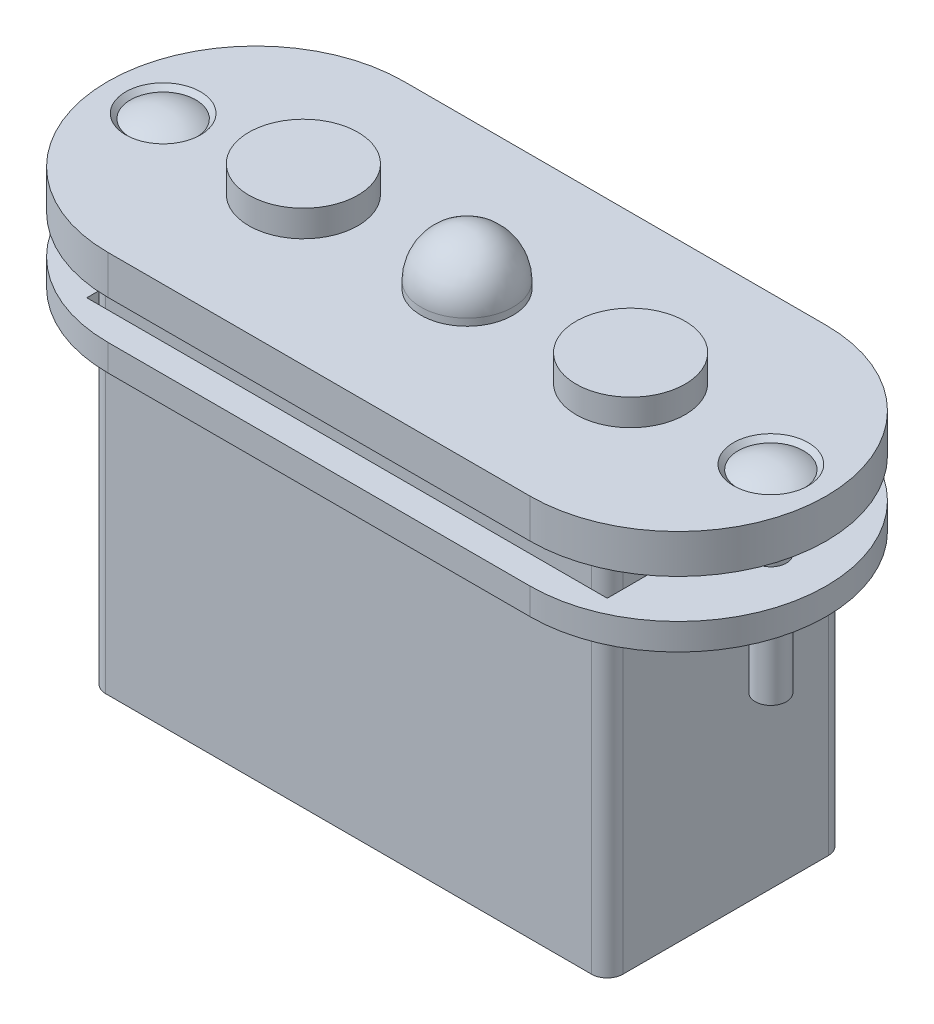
ISO-10303-21;
HEADER;
FILE_DESCRIPTION(('STEP AP214'),'2;1');
FILE_NAME('part.step','',(''),(''),'','','');
FILE_SCHEMA(('AUTOMOTIVE_DESIGN { 1 0 10303 214 1 1 1 1 }'));
ENDSEC;
DATA;
#1=APPLICATION_CONTEXT('core data for automotive mechanical design processes');
#2=APPLICATION_PROTOCOL_DEFINITION('international standard','automotive_design',2000,#1);
#3=PRODUCT_CONTEXT('',#1,'mechanical');
#4=PRODUCT('Part','Part','',(#3));
#5=PRODUCT_RELATED_PRODUCT_CATEGORY('part','',(#4));
#6=PRODUCT_DEFINITION_FORMATION('','',#4);
#7=PRODUCT_DEFINITION_CONTEXT('part definition',#1,'design');
#8=PRODUCT_DEFINITION('design','',#6,#7);
#9=PRODUCT_DEFINITION_SHAPE('','',#8);
#10=(LENGTH_UNIT() NAMED_UNIT(*) SI_UNIT(.MILLI.,.METRE.));
#11=(NAMED_UNIT(*) PLANE_ANGLE_UNIT() SI_UNIT($,.RADIAN.));
#12=(NAMED_UNIT(*) SI_UNIT($,.STERADIAN.) SOLID_ANGLE_UNIT());
#13=UNCERTAINTY_MEASURE_WITH_UNIT(LENGTH_MEASURE(1.E-05),#10,'distance_accuracy_value','');
#14=(GEOMETRIC_REPRESENTATION_CONTEXT(3) GLOBAL_UNCERTAINTY_ASSIGNED_CONTEXT((#13)) GLOBAL_UNIT_ASSIGNED_CONTEXT((#10,
#11,#12)) REPRESENTATION_CONTEXT('',''));
#15=CARTESIAN_POINT('',(0.,0.,0.));
#16=DIRECTION('',(0.,0.,1.));
#17=DIRECTION('',(1.,0.,0.));
#18=AXIS2_PLACEMENT_3D('',#15,#16,#17);
#19=CARTESIAN_POINT('',(19.5,-1.17500000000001,0.));
#20=DIRECTION('',(0.,1.,0.));
#21=DIRECTION('',(1.,0.,0.));
#22=AXIS2_PLACEMENT_3D('',#19,#20,#21);
#23=SPHERICAL_SURFACE('',#22,3.97500000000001);
#24=CARTESIAN_POINT('',(19.5,2.2,0.));
#25=DIRECTION('',(0.,1.,0.));
#26=DIRECTION('',(0.,0.,1.));
#27=AXIS2_PLACEMENT_3D('',#24,#25,#26);
#28=CIRCLE('',#27,2.1);
#29=CARTESIAN_POINT('',(19.5,2.2,2.1));
#30=VERTEX_POINT('',#29);
#31=EDGE_CURVE('E11',#30,#30,#28,.T.);
#32=ORIENTED_EDGE('',*,*,#31,.T.);
#33=EDGE_LOOP('',(#32));
#34=FACE_BOUND('',#33,.T.);
#35=ADVANCED_FACE('F46',(#34),#23,.T.);
#36=CARTESIAN_POINT('',(19.5,2.2,0.));
#37=DIRECTION('',(0.,1.,0.));
#38=DIRECTION('',(0.,0.,1.));
#39=AXIS2_PLACEMENT_3D('',#36,#37,#38);
#40=CONICAL_SURFACE('',#39,2.1,0.785398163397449);
#41=CARTESIAN_POINT('',(19.5,1.1,0.));
#42=DIRECTION('',(0.,1.,0.));
#43=DIRECTION('',(0.,0.,1.));
#44=AXIS2_PLACEMENT_3D('',#41,#42,#43);
#45=CIRCLE('',#44,1.);
#46=CARTESIAN_POINT('',(19.5,1.1,1.));
#47=VERTEX_POINT('',#46);
#48=EDGE_CURVE('E52',#47,#47,#45,.T.);
#49=ORIENTED_EDGE('',*,*,#48,.T.);
#50=EDGE_LOOP('',(#49));
#51=FACE_BOUND('',#50,.T.);
#52=ORIENTED_EDGE('',*,*,#31,.F.);
#53=EDGE_LOOP('',(#52));
#54=FACE_BOUND('',#53,.T.);
#55=ADVANCED_FACE('F72',(#51,#54),#40,.T.);
#56=CARTESIAN_POINT('',(19.5,1.15,0.));
#57=DIRECTION('',(0.,1.,0.));
#58=DIRECTION('',(0.,0.,1.));
#59=AXIS2_PLACEMENT_3D('',#56,#57,#58);
#60=CYLINDRICAL_SURFACE('',#59,0.999999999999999);
#61=CARTESIAN_POINT('',(19.5,-10.2,0.));
#62=DIRECTION('',(0.,1.,0.));
#63=DIRECTION('',(0.,0.,1.));
#64=AXIS2_PLACEMENT_3D('',#61,#62,#63);
#65=CIRCLE('',#64,0.999999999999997);
#66=CARTESIAN_POINT('',(19.5,-10.2,0.999999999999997));
#67=VERTEX_POINT('',#66);
#68=EDGE_CURVE('E56',#67,#67,#65,.T.);
#69=ORIENTED_EDGE('',*,*,#68,.T.);
#70=EDGE_LOOP('',(#69));
#71=FACE_BOUND('',#70,.T.);
#72=ORIENTED_EDGE('',*,*,#48,.F.);
#73=EDGE_LOOP('',(#72));
#74=FACE_BOUND('',#73,.T.);
#75=ADVANCED_FACE('F63',(#71,#74),#60,.T.);
#76=CARTESIAN_POINT('',(18.5,-10.2,0.));
#77=DIRECTION('',(0.,-1.,0.));
#78=DIRECTION('',(0.,0.,-1.));
#79=AXIS2_PLACEMENT_3D('',#76,#77,#78);
#80=PLANE('',#79);
#81=ORIENTED_EDGE('',*,*,#68,.F.);
#82=EDGE_LOOP('',(#81));
#83=FACE_BOUND('',#82,.T.);
#84=ADVANCED_FACE('F66',(#83),#80,.T.);
#85=CLOSED_SHELL('',(#35,#55,#75,#84));
#86=MANIFOLD_SOLID_BREP('B2',#85);
#87=CARTESIAN_POINT('',(-19.5,-1.17500000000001,0.));
#88=DIRECTION('',(0.,1.,0.));
#89=DIRECTION('',(1.,0.,0.));
#90=AXIS2_PLACEMENT_3D('',#87,#88,#89);
#91=SPHERICAL_SURFACE('',#90,3.97500000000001);
#92=CARTESIAN_POINT('',(-19.5,2.2,0.));
#93=DIRECTION('',(0.,1.,0.));
#94=DIRECTION('',(0.,0.,1.));
#95=AXIS2_PLACEMENT_3D('',#92,#93,#94);
#96=CIRCLE('',#95,2.1);
#97=CARTESIAN_POINT('',(-19.5,2.2,2.1));
#98=VERTEX_POINT('',#97);
#99=EDGE_CURVE('E45',#98,#98,#96,.T.);
#100=ORIENTED_EDGE('',*,*,#99,.T.);
#101=EDGE_LOOP('',(#100));
#102=FACE_BOUND('',#101,.T.);
#103=ADVANCED_FACE('F112',(#102),#91,.T.);
#104=CARTESIAN_POINT('',(-19.5,2.2,0.));
#105=DIRECTION('',(0.,1.,0.));
#106=DIRECTION('',(0.,0.,1.));
#107=AXIS2_PLACEMENT_3D('',#104,#105,#106);
#108=CONICAL_SURFACE('',#107,2.1,0.785398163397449);
#109=CARTESIAN_POINT('',(-19.5,1.1,0.));
#110=DIRECTION('',(0.,1.,0.));
#111=DIRECTION('',(0.,0.,1.));
#112=AXIS2_PLACEMENT_3D('',#109,#110,#111);
#113=CIRCLE('',#112,1.);
#114=CARTESIAN_POINT('',(-19.5,1.1,1.));
#115=VERTEX_POINT('',#114);
#116=EDGE_CURVE('E118',#115,#115,#113,.T.);
#117=ORIENTED_EDGE('',*,*,#116,.T.);
#118=EDGE_LOOP('',(#117));
#119=FACE_BOUND('',#118,.T.);
#120=ORIENTED_EDGE('',*,*,#99,.F.);
#121=EDGE_LOOP('',(#120));
#122=FACE_BOUND('',#121,.T.);
#123=ADVANCED_FACE('F138',(#119,#122),#108,.T.);
#124=CARTESIAN_POINT('',(-19.5,1.15,0.));
#125=DIRECTION('',(0.,1.,0.));
#126=DIRECTION('',(0.,0.,1.));
#127=AXIS2_PLACEMENT_3D('',#124,#125,#126);
#128=CYLINDRICAL_SURFACE('',#127,0.999999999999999);
#129=CARTESIAN_POINT('',(-19.5,-10.2,0.));
#130=DIRECTION('',(0.,1.,0.));
#131=DIRECTION('',(0.,0.,1.));
#132=AXIS2_PLACEMENT_3D('',#129,#130,#131);
#133=CIRCLE('',#132,0.999999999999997);
#134=CARTESIAN_POINT('',(-19.5,-10.2,0.999999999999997));
#135=VERTEX_POINT('',#134);
#136=EDGE_CURVE('E122',#135,#135,#133,.T.);
#137=ORIENTED_EDGE('',*,*,#136,.T.);
#138=EDGE_LOOP('',(#137));
#139=FACE_BOUND('',#138,.T.);
#140=ORIENTED_EDGE('',*,*,#116,.F.);
#141=EDGE_LOOP('',(#140));
#142=FACE_BOUND('',#141,.T.);
#143=ADVANCED_FACE('F129',(#139,#142),#128,.T.);
#144=CARTESIAN_POINT('',(-20.5,-10.2,0.));
#145=DIRECTION('',(0.,-1.,0.));
#146=DIRECTION('',(0.,0.,-1.));
#147=AXIS2_PLACEMENT_3D('',#144,#145,#146);
#148=PLANE('',#147);
#149=ORIENTED_EDGE('',*,*,#136,.F.);
#150=EDGE_LOOP('',(#149));
#151=FACE_BOUND('',#150,.T.);
#152=ADVANCED_FACE('F132',(#151),#148,.T.);
#153=CLOSED_SHELL('',(#103,#123,#143,#152));
#154=MANIFOLD_SOLID_BREP('B6',#153);
#155=CARTESIAN_POINT('',(-13.55,-4.2,0.));
#156=DIRECTION('',(0.,-1.,0.));
#157=DIRECTION('',(0.,0.,-1.));
#158=AXIS2_PLACEMENT_3D('',#155,#156,#157);
#159=PLANE('',#158);
#160=CARTESIAN_POINT('',(-13.55,-4.2,0.));
#161=DIRECTION('',(0.,-1.,0.));
#162=DIRECTION('',(0.,0.,-1.));
#163=AXIS2_PLACEMENT_3D('',#160,#161,#162);
#164=CIRCLE('',#163,9.5);
#165=CARTESIAN_POINT('',(-13.55,-4.2,9.5));
#166=VERTEX_POINT('',#165);
#167=CARTESIAN_POINT('',(-13.55,-4.2,-9.5));
#168=VERTEX_POINT('',#167);
#169=EDGE_CURVE('E278',#166,#168,#164,.T.);
#170=ORIENTED_EDGE('',*,*,#169,.T.);
#171=DIRECTION('',(1.,0.,0.));
#172=VECTOR('',#171,1.);
#173=CARTESIAN_POINT('',(-13.55,-4.2,-9.5));
#174=LINE('',#173,#172);
#175=CARTESIAN_POINT('',(13.55,-4.2,-9.5));
#176=VERTEX_POINT('',#175);
#177=EDGE_CURVE('E281',#168,#176,#174,.T.);
#178=ORIENTED_EDGE('',*,*,#177,.T.);
#179=CARTESIAN_POINT('',(13.55,-4.2,0.));
#180=DIRECTION('',(0.,-1.,0.));
#181=DIRECTION('',(0.,0.,-1.));
#182=AXIS2_PLACEMENT_3D('',#179,#180,#181);
#183=CIRCLE('',#182,9.5);
#184=CARTESIAN_POINT('',(13.55,-4.2,9.5));
#185=VERTEX_POINT('',#184);
#186=EDGE_CURVE('E284',#176,#185,#183,.T.);
#187=ORIENTED_EDGE('',*,*,#186,.T.);
#188=DIRECTION('',(-1.,0.,0.));
#189=VECTOR('',#188,1.);
#190=CARTESIAN_POINT('',(13.55,-4.2,9.5));
#191=LINE('',#190,#189);
#192=EDGE_CURVE('E286',#185,#166,#191,.T.);
#193=ORIENTED_EDGE('',*,*,#192,.T.);
#194=EDGE_LOOP('',(#170,#178,#187,#193));
#195=FACE_BOUND('',#194,.T.);
#196=DIRECTION('',(-1.,0.,0.));
#197=VECTOR('',#196,1.);
#198=CARTESIAN_POINT('',(-16.7,-4.2,7.7));
#199=LINE('',#198,#197);
#200=CARTESIAN_POINT('',(16.7,-4.2,7.7));
#201=VERTEX_POINT('',#200);
#202=CARTESIAN_POINT('',(-16.7,-4.2,7.7));
#203=VERTEX_POINT('',#202);
#204=EDGE_CURVE('E250',#201,#203,#199,.T.);
#205=ORIENTED_EDGE('',*,*,#204,.F.);
#206=DIRECTION('',(0.,0.,1.));
#207=VECTOR('',#206,1.);
#208=CARTESIAN_POINT('',(16.7,-4.2,-7.7));
#209=LINE('',#208,#207);
#210=CARTESIAN_POINT('',(16.7,-4.2,-7.7));
#211=VERTEX_POINT('',#210);
#212=EDGE_CURVE('E242',#211,#201,#209,.T.);
#213=ORIENTED_EDGE('',*,*,#212,.F.);
#214=DIRECTION('',(1.,0.,0.));
#215=VECTOR('',#214,1.);
#216=CARTESIAN_POINT('',(-16.7,-4.2,-7.7));
#217=LINE('',#216,#215);
#218=CARTESIAN_POINT('',(-16.7,-4.2,-7.7));
#219=VERTEX_POINT('',#218);
#220=EDGE_CURVE('E264',#219,#211,#217,.T.);
#221=ORIENTED_EDGE('',*,*,#220,.F.);
#222=DIRECTION('',(0.,0.,-1.));
#223=VECTOR('',#222,1.);
#224=CARTESIAN_POINT('',(-16.7,-4.2,-7.7));
#225=LINE('',#224,#223);
#226=EDGE_CURVE('E262',#203,#219,#225,.T.);
#227=ORIENTED_EDGE('',*,*,#226,.F.);
#228=EDGE_LOOP('',(#205,#213,#221,#227));
#229=FACE_BOUND('',#228,.T.);
#230=ADVANCED_FACE('F177',(#195,#229),#159,.T.);
#231=CARTESIAN_POINT('',(-13.55,-2.5,0.));
#232=DIRECTION('',(0.,-1.,0.));
#233=DIRECTION('',(0.,0.,-1.));
#234=AXIS2_PLACEMENT_3D('',#231,#232,#233);
#235=PLANE('',#234);
#236=CARTESIAN_POINT('',(-13.55,-2.5,0.));
#237=DIRECTION('',(0.,-1.,0.));
#238=DIRECTION('',(0.,0.,-1.));
#239=AXIS2_PLACEMENT_3D('',#236,#237,#238);
#240=CIRCLE('',#239,9.5);
#241=CARTESIAN_POINT('',(-13.55,-2.5,9.5));
#242=VERTEX_POINT('',#241);
#243=CARTESIAN_POINT('',(-13.55,-2.5,-9.5));
#244=VERTEX_POINT('',#243);
#245=EDGE_CURVE('E258',#242,#244,#240,.T.);
#246=ORIENTED_EDGE('',*,*,#245,.F.);
#247=DIRECTION('',(-1.,0.,0.));
#248=VECTOR('',#247,1.);
#249=CARTESIAN_POINT('',(13.55,-2.5,9.5));
#250=LINE('',#249,#248);
#251=CARTESIAN_POINT('',(13.55,-2.5,9.5));
#252=VERTEX_POINT('',#251);
#253=EDGE_CURVE('E282',#252,#242,#250,.T.);
#254=ORIENTED_EDGE('',*,*,#253,.F.);
#255=CARTESIAN_POINT('',(13.55,-2.5,0.));
#256=DIRECTION('',(0.,-1.,0.));
#257=DIRECTION('',(0.,0.,-1.));
#258=AXIS2_PLACEMENT_3D('',#255,#256,#257);
#259=CIRCLE('',#258,9.5);
#260=CARTESIAN_POINT('',(13.55,-2.5,-9.5));
#261=VERTEX_POINT('',#260);
#262=EDGE_CURVE('E293',#261,#252,#259,.T.);
#263=ORIENTED_EDGE('',*,*,#262,.F.);
#264=DIRECTION('',(1.,0.,0.));
#265=VECTOR('',#264,1.);
#266=CARTESIAN_POINT('',(-13.55,-2.5,-9.5));
#267=LINE('',#266,#265);
#268=EDGE_CURVE('E291',#244,#261,#267,.T.);
#269=ORIENTED_EDGE('',*,*,#268,.F.);
#270=EDGE_LOOP('',(#246,#254,#263,#269));
#271=FACE_BOUND('',#270,.T.);
#272=DIRECTION('',(0.,0.,1.));
#273=VECTOR('',#272,1.);
#274=CARTESIAN_POINT('',(16.7,-2.5,-7.7));
#275=LINE('',#274,#273);
#276=CARTESIAN_POINT('',(16.7,-2.5,-7.7));
#277=VERTEX_POINT('',#276);
#278=CARTESIAN_POINT('',(16.7,-2.5,7.7));
#279=VERTEX_POINT('',#278);
#280=EDGE_CURVE('E200',#277,#279,#275,.T.);
#281=ORIENTED_EDGE('',*,*,#280,.T.);
#282=DIRECTION('',(-1.,0.,0.));
#283=VECTOR('',#282,1.);
#284=CARTESIAN_POINT('',(-16.7,-2.5,7.7));
#285=LINE('',#284,#283);
#286=CARTESIAN_POINT('',(-16.7,-2.5,7.7));
#287=VERTEX_POINT('',#286);
#288=EDGE_CURVE('E257',#279,#287,#285,.T.);
#289=ORIENTED_EDGE('',*,*,#288,.T.);
#290=DIRECTION('',(0.,0.,-1.));
#291=VECTOR('',#290,1.);
#292=CARTESIAN_POINT('',(-16.7,-2.5,-7.7));
#293=LINE('',#292,#291);
#294=CARTESIAN_POINT('',(-16.7,-2.5,-7.7));
#295=VERTEX_POINT('',#294);
#296=EDGE_CURVE('E270',#287,#295,#293,.T.);
#297=ORIENTED_EDGE('',*,*,#296,.T.);
#298=DIRECTION('',(1.,0.,0.));
#299=VECTOR('',#298,1.);
#300=CARTESIAN_POINT('',(-16.7,-2.5,-7.7));
#301=LINE('',#300,#299);
#302=EDGE_CURVE('E251',#295,#277,#301,.T.);
#303=ORIENTED_EDGE('',*,*,#302,.T.);
#304=EDGE_LOOP('',(#281,#289,#297,#303));
#305=FACE_BOUND('',#304,.T.);
#306=ADVANCED_FACE('F311',(#271,#305),#235,.F.);
#307=CARTESIAN_POINT('',(-13.55,-4.2,0.));
#308=DIRECTION('',(0.,1.,0.));
#309=DIRECTION('',(0.,0.,1.));
#310=AXIS2_PLACEMENT_3D('',#307,#308,#309);
#311=CYLINDRICAL_SURFACE('',#310,9.5);
#312=ORIENTED_EDGE('',*,*,#245,.T.);
#313=DIRECTION('',(0.,1.,0.));
#314=VECTOR('',#313,1.);
#315=CARTESIAN_POINT('',(-13.55,-4.2,-9.5));
#316=LINE('',#315,#314);
#317=EDGE_CURVE('E110',#168,#244,#316,.T.);
#318=ORIENTED_EDGE('',*,*,#317,.F.);
#319=ORIENTED_EDGE('',*,*,#169,.F.);
#320=DIRECTION('',(0.,1.,0.));
#321=VECTOR('',#320,1.);
#322=CARTESIAN_POINT('',(-13.55,-4.2,9.5));
#323=LINE('',#322,#321);
#324=EDGE_CURVE('E288',#166,#242,#323,.T.);
#325=ORIENTED_EDGE('',*,*,#324,.T.);
#326=EDGE_LOOP('',(#312,#318,#319,#325));
#327=FACE_BOUND('',#326,.T.);
#328=ADVANCED_FACE('F179',(#327),#311,.T.);
#329=CARTESIAN_POINT('',(-13.55,-4.2,-9.5));
#330=DIRECTION('',(0.,0.,1.));
#331=DIRECTION('',(1.,0.,0.));
#332=AXIS2_PLACEMENT_3D('',#329,#330,#331);
#333=PLANE('',#332);
#334=ORIENTED_EDGE('',*,*,#268,.T.);
#335=DIRECTION('',(0.,1.,0.));
#336=VECTOR('',#335,1.);
#337=CARTESIAN_POINT('',(13.55,-4.2,-9.5));
#338=LINE('',#337,#336);
#339=EDGE_CURVE('E185',#176,#261,#338,.T.);
#340=ORIENTED_EDGE('',*,*,#339,.F.);
#341=ORIENTED_EDGE('',*,*,#177,.F.);
#342=ORIENTED_EDGE('',*,*,#317,.T.);
#343=EDGE_LOOP('',(#334,#340,#341,#342));
#344=FACE_BOUND('',#343,.T.);
#345=ADVANCED_FACE('F321',(#344),#333,.F.);
#346=CARTESIAN_POINT('',(13.55,-4.2,0.));
#347=DIRECTION('',(0.,1.,0.));
#348=DIRECTION('',(0.,0.,1.));
#349=AXIS2_PLACEMENT_3D('',#346,#347,#348);
#350=CYLINDRICAL_SURFACE('',#349,9.5);
#351=ORIENTED_EDGE('',*,*,#262,.T.);
#352=DIRECTION('',(0.,1.,0.));
#353=VECTOR('',#352,1.);
#354=CARTESIAN_POINT('',(13.55,-4.2,9.5));
#355=LINE('',#354,#353);
#356=EDGE_CURVE('E298',#185,#252,#355,.T.);
#357=ORIENTED_EDGE('',*,*,#356,.F.);
#358=ORIENTED_EDGE('',*,*,#186,.F.);
#359=ORIENTED_EDGE('',*,*,#339,.T.);
#360=EDGE_LOOP('',(#351,#357,#358,#359));
#361=FACE_BOUND('',#360,.T.);
#362=ADVANCED_FACE('F305',(#361),#350,.T.);
#363=CARTESIAN_POINT('',(13.55,-4.2,9.5));
#364=DIRECTION('',(0.,0.,-1.));
#365=DIRECTION('',(-1.,0.,0.));
#366=AXIS2_PLACEMENT_3D('',#363,#364,#365);
#367=PLANE('',#366);
#368=ORIENTED_EDGE('',*,*,#253,.T.);
#369=ORIENTED_EDGE('',*,*,#324,.F.);
#370=ORIENTED_EDGE('',*,*,#192,.F.);
#371=ORIENTED_EDGE('',*,*,#356,.T.);
#372=EDGE_LOOP('',(#368,#369,#370,#371));
#373=FACE_BOUND('',#372,.T.);
#374=ADVANCED_FACE('F315',(#373),#367,.F.);
#375=CARTESIAN_POINT('',(16.7,-4.2,-7.7));
#376=DIRECTION('',(-1.,0.,0.));
#377=DIRECTION('',(0.,0.,1.));
#378=AXIS2_PLACEMENT_3D('',#375,#376,#377);
#379=PLANE('',#378);
#380=ORIENTED_EDGE('',*,*,#280,.F.);
#381=DIRECTION('',(0.,1.,0.));
#382=VECTOR('',#381,1.);
#383=CARTESIAN_POINT('',(16.7,-4.2,-7.7));
#384=LINE('',#383,#382);
#385=EDGE_CURVE('E246',#211,#277,#384,.T.);
#386=ORIENTED_EDGE('',*,*,#385,.F.);
#387=ORIENTED_EDGE('',*,*,#212,.T.);
#388=DIRECTION('',(0.,1.,0.));
#389=VECTOR('',#388,1.);
#390=CARTESIAN_POINT('',(16.7,-4.2,7.7));
#391=LINE('',#390,#389);
#392=EDGE_CURVE('E245',#201,#279,#391,.T.);
#393=ORIENTED_EDGE('',*,*,#392,.T.);
#394=EDGE_LOOP('',(#380,#386,#387,#393));
#395=FACE_BOUND('',#394,.T.);
#396=ADVANCED_FACE('F244',(#395),#379,.T.);
#397=CARTESIAN_POINT('',(-16.7,-4.2,7.7));
#398=DIRECTION('',(0.,0.,-1.));
#399=DIRECTION('',(-1.,0.,0.));
#400=AXIS2_PLACEMENT_3D('',#397,#398,#399);
#401=PLANE('',#400);
#402=ORIENTED_EDGE('',*,*,#288,.F.);
#403=ORIENTED_EDGE('',*,*,#392,.F.);
#404=ORIENTED_EDGE('',*,*,#204,.T.);
#405=DIRECTION('',(0.,1.,0.));
#406=VECTOR('',#405,1.);
#407=CARTESIAN_POINT('',(-16.7,-4.2,7.7));
#408=LINE('',#407,#406);
#409=EDGE_CURVE('E259',#203,#287,#408,.T.);
#410=ORIENTED_EDGE('',*,*,#409,.T.);
#411=EDGE_LOOP('',(#402,#403,#404,#410));
#412=FACE_BOUND('',#411,.T.);
#413=ADVANCED_FACE('F254',(#412),#401,.T.);
#414=CARTESIAN_POINT('',(-16.7,-4.2,-7.7));
#415=DIRECTION('',(1.,0.,0.));
#416=DIRECTION('',(0.,0.,-1.));
#417=AXIS2_PLACEMENT_3D('',#414,#415,#416);
#418=PLANE('',#417);
#419=ORIENTED_EDGE('',*,*,#296,.F.);
#420=ORIENTED_EDGE('',*,*,#409,.F.);
#421=ORIENTED_EDGE('',*,*,#226,.T.);
#422=DIRECTION('',(0.,1.,0.));
#423=VECTOR('',#422,1.);
#424=CARTESIAN_POINT('',(-16.7,-4.2,-7.7));
#425=LINE('',#424,#423);
#426=EDGE_CURVE('E192',#219,#295,#425,.T.);
#427=ORIENTED_EDGE('',*,*,#426,.T.);
#428=EDGE_LOOP('',(#419,#420,#421,#427));
#429=FACE_BOUND('',#428,.T.);
#430=ADVANCED_FACE('F344',(#429),#418,.T.);
#431=CARTESIAN_POINT('',(-16.7,-4.2,-7.7));
#432=DIRECTION('',(0.,0.,1.));
#433=DIRECTION('',(1.,0.,0.));
#434=AXIS2_PLACEMENT_3D('',#431,#432,#433);
#435=PLANE('',#434);
#436=ORIENTED_EDGE('',*,*,#302,.F.);
#437=ORIENTED_EDGE('',*,*,#426,.F.);
#438=ORIENTED_EDGE('',*,*,#220,.T.);
#439=ORIENTED_EDGE('',*,*,#385,.T.);
#440=EDGE_LOOP('',(#436,#437,#438,#439));
#441=FACE_BOUND('',#440,.T.);
#442=ADVANCED_FACE('F348',(#441),#435,.T.);
#443=CLOSED_SHELL('',(#230,#306,#328,#345,#362,#374,#396,#413,#430,#442));
#444=MANIFOLD_SOLID_BREP('B40',#443);
#445=CARTESIAN_POINT('',(-13.55,0.,0.));
#446=DIRECTION('',(0.,1.,0.));
#447=DIRECTION('',(0.,0.,1.));
#448=AXIS2_PLACEMENT_3D('',#445,#446,#447);
#449=PLANE('',#448);
#450=CARTESIAN_POINT('',(-19.5,0.,0.));
#451=DIRECTION('',(0.,1.,0.));
#452=DIRECTION('',(0.,0.,1.));
#453=AXIS2_PLACEMENT_3D('',#450,#451,#452);
#454=CIRCLE('',#453,1.04999999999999);
#455=CARTESIAN_POINT('',(-19.5,0.,1.05));
#456=VERTEX_POINT('',#455);
#457=EDGE_CURVE('E410',#456,#456,#454,.T.);
#458=ORIENTED_EDGE('',*,*,#457,.T.);
#459=EDGE_LOOP('',(#458));
#460=FACE_BOUND('',#459,.T.);
#461=CARTESIAN_POINT('',(19.5,0.,0.));
#462=DIRECTION('',(0.,1.,0.));
#463=DIRECTION('',(0.,0.,1.));
#464=AXIS2_PLACEMENT_3D('',#461,#462,#463);
#465=CIRCLE('',#464,1.04999999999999);
#466=CARTESIAN_POINT('',(19.5,0.,1.05));
#467=VERTEX_POINT('',#466);
#468=EDGE_CURVE('E659',#467,#467,#465,.T.);
#469=ORIENTED_EDGE('',*,*,#468,.T.);
#470=EDGE_LOOP('',(#469));
#471=FACE_BOUND('',#470,.T.);
#472=CARTESIAN_POINT('',(-13.55,0.,0.));
#473=DIRECTION('',(0.,1.,0.));
#474=DIRECTION('',(0.,0.,1.));
#475=AXIS2_PLACEMENT_3D('',#472,#473,#474);
#476=CIRCLE('',#475,9.5);
#477=CARTESIAN_POINT('',(-13.55,0.,-9.5));
#478=VERTEX_POINT('',#477);
#479=CARTESIAN_POINT('',(-13.55,0.,9.5));
#480=VERTEX_POINT('',#479);
#481=EDGE_CURVE('E673',#478,#480,#476,.T.);
#482=ORIENTED_EDGE('',*,*,#481,.F.);
#483=DIRECTION('',(-1.,0.,0.));
#484=VECTOR('',#483,1.);
#485=CARTESIAN_POINT('',(-13.55,0.,-9.5));
#486=LINE('',#485,#484);
#487=CARTESIAN_POINT('',(13.55,0.,-9.5));
#488=VERTEX_POINT('',#487);
#489=EDGE_CURVE('E689',#488,#478,#486,.T.);
#490=ORIENTED_EDGE('',*,*,#489,.F.);
#491=CARTESIAN_POINT('',(13.55,0.,0.));
#492=DIRECTION('',(0.,1.,0.));
#493=DIRECTION('',(0.,0.,1.));
#494=AXIS2_PLACEMENT_3D('',#491,#492,#493);
#495=CIRCLE('',#494,9.5);
#496=CARTESIAN_POINT('',(13.55,0.,9.5));
#497=VERTEX_POINT('',#496);
#498=EDGE_CURVE('E700',#497,#488,#495,.T.);
#499=ORIENTED_EDGE('',*,*,#498,.F.);
#500=DIRECTION('',(1.,0.,0.));
#501=VECTOR('',#500,1.);
#502=CARTESIAN_POINT('',(-13.55,0.,9.5));
#503=LINE('',#502,#501);
#504=EDGE_CURVE('E698',#480,#497,#503,.T.);
#505=ORIENTED_EDGE('',*,*,#504,.F.);
#506=EDGE_LOOP('',(#482,#490,#499,#505));
#507=FACE_BOUND('',#506,.T.);
#508=DIRECTION('',(0.,0.,1.));
#509=VECTOR('',#508,1.);
#510=CARTESIAN_POINT('',(16.6,0.,7.6));
#511=LINE('',#510,#509);
#512=CARTESIAN_POINT('',(16.6,0.,-6.6));
#513=VERTEX_POINT('',#512);
#514=CARTESIAN_POINT('',(16.6,0.,6.6));
#515=VERTEX_POINT('',#514);
#516=EDGE_CURVE('E674',#513,#515,#511,.T.);
#517=ORIENTED_EDGE('',*,*,#516,.F.);
#518=CARTESIAN_POINT('',(15.6,0.,-6.6));
#519=DIRECTION('',(0.,1.,0.));
#520=DIRECTION('',(0.,0.,1.));
#521=AXIS2_PLACEMENT_3D('',#518,#519,#520);
#522=CIRCLE('',#521,1.);
#523=CARTESIAN_POINT('',(15.6,0.,-7.6));
#524=VERTEX_POINT('',#523);
#525=EDGE_CURVE('E744',#513,#524,#522,.T.);
#526=ORIENTED_EDGE('',*,*,#525,.T.);
#527=DIRECTION('',(1.,0.,0.));
#528=VECTOR('',#527,1.);
#529=CARTESIAN_POINT('',(-16.6,0.,-7.6));
#530=LINE('',#529,#528);
#531=CARTESIAN_POINT('',(-15.6,0.,-7.6));
#532=VERTEX_POINT('',#531);
#533=EDGE_CURVE('E664',#532,#524,#530,.T.);
#534=ORIENTED_EDGE('',*,*,#533,.F.);
#535=CARTESIAN_POINT('',(-15.6,0.,-6.6));
#536=DIRECTION('',(0.,1.,0.));
#537=DIRECTION('',(0.,0.,1.));
#538=AXIS2_PLACEMENT_3D('',#535,#536,#537);
#539=CIRCLE('',#538,1.);
#540=CARTESIAN_POINT('',(-16.6,0.,-6.6));
#541=VERTEX_POINT('',#540);
#542=EDGE_CURVE('E415',#532,#541,#539,.T.);
#543=ORIENTED_EDGE('',*,*,#542,.T.);
#544=DIRECTION('',(0.,0.,-1.));
#545=VECTOR('',#544,1.);
#546=CARTESIAN_POINT('',(-16.6,0.,7.6));
#547=LINE('',#546,#545);
#548=CARTESIAN_POINT('',(-16.6,0.,6.6));
#549=VERTEX_POINT('',#548);
#550=EDGE_CURVE('E680',#549,#541,#547,.T.);
#551=ORIENTED_EDGE('',*,*,#550,.F.);
#552=CARTESIAN_POINT('',(-15.6,0.,6.6));
#553=DIRECTION('',(0.,1.,0.));
#554=DIRECTION('',(0.,0.,1.));
#555=AXIS2_PLACEMENT_3D('',#552,#553,#554);
#556=CIRCLE('',#555,1.);
#557=CARTESIAN_POINT('',(-15.6,0.,7.6));
#558=VERTEX_POINT('',#557);
#559=EDGE_CURVE('E175',#549,#558,#556,.T.);
#560=ORIENTED_EDGE('',*,*,#559,.T.);
#561=DIRECTION('',(-1.,0.,0.));
#562=VECTOR('',#561,1.);
#563=CARTESIAN_POINT('',(-16.6,0.,7.6));
#564=LINE('',#563,#562);
#565=CARTESIAN_POINT('',(15.6,0.,7.6));
#566=VERTEX_POINT('',#565);
#567=EDGE_CURVE('E677',#566,#558,#564,.T.);
#568=ORIENTED_EDGE('',*,*,#567,.F.);
#569=CARTESIAN_POINT('',(15.6,0.,6.6));
#570=DIRECTION('',(0.,1.,0.));
#571=DIRECTION('',(0.,0.,1.));
#572=AXIS2_PLACEMENT_3D('',#569,#570,#571);
#573=CIRCLE('',#572,1.);
#574=EDGE_CURVE('E742',#566,#515,#573,.T.);
#575=ORIENTED_EDGE('',*,*,#574,.T.);
#576=EDGE_LOOP('',(#517,#526,#534,#543,#551,#560,#568,#575));
#577=FACE_BOUND('',#576,.T.);
#578=ADVANCED_FACE('F406',(#460,#471,#507,#577),#449,.F.);
#579=CARTESIAN_POINT('',(-13.55,2.5,0.));
#580=DIRECTION('',(0.,-1.,0.));
#581=DIRECTION('',(0.,0.,-1.));
#582=AXIS2_PLACEMENT_3D('',#579,#580,#581);
#583=CYLINDRICAL_SURFACE('',#582,9.5);
#584=ORIENTED_EDGE('',*,*,#481,.T.);
#585=DIRECTION('',(0.,-1.,0.));
#586=VECTOR('',#585,1.);
#587=CARTESIAN_POINT('',(-13.55,2.5,9.5));
#588=LINE('',#587,#586);
#589=CARTESIAN_POINT('',(-13.55,2.5,9.5));
#590=VERTEX_POINT('',#589);
#591=EDGE_CURVE('E711',#590,#480,#588,.T.);
#592=ORIENTED_EDGE('',*,*,#591,.F.);
#593=CARTESIAN_POINT('',(-13.55,2.5,0.));
#594=DIRECTION('',(0.,1.,0.));
#595=DIRECTION('',(0.,0.,1.));
#596=AXIS2_PLACEMENT_3D('',#593,#594,#595);
#597=CIRCLE('',#596,9.5);
#598=CARTESIAN_POINT('',(-13.55,2.5,-9.5));
#599=VERTEX_POINT('',#598);
#600=EDGE_CURVE('E685',#599,#590,#597,.T.);
#601=ORIENTED_EDGE('',*,*,#600,.F.);
#602=DIRECTION('',(0.,-1.,0.));
#603=VECTOR('',#602,1.);
#604=CARTESIAN_POINT('',(-13.55,2.5,-9.5));
#605=LINE('',#604,#603);
#606=EDGE_CURVE('E695',#599,#478,#605,.T.);
#607=ORIENTED_EDGE('',*,*,#606,.T.);
#608=EDGE_LOOP('',(#584,#592,#601,#607));
#609=FACE_BOUND('',#608,.T.);
#610=ADVANCED_FACE('F767',(#609),#583,.T.);
#611=CARTESIAN_POINT('',(-13.55,2.5,9.5));
#612=DIRECTION('',(0.,0.,-1.));
#613=DIRECTION('',(-1.,0.,0.));
#614=AXIS2_PLACEMENT_3D('',#611,#612,#613);
#615=PLANE('',#614);
#616=ORIENTED_EDGE('',*,*,#504,.T.);
#617=DIRECTION('',(0.,-1.,0.));
#618=VECTOR('',#617,1.);
#619=CARTESIAN_POINT('',(13.55,2.5,9.5));
#620=LINE('',#619,#618);
#621=CARTESIAN_POINT('',(13.55,2.5,9.5));
#622=VERTEX_POINT('',#621);
#623=EDGE_CURVE('E708',#622,#497,#620,.T.);
#624=ORIENTED_EDGE('',*,*,#623,.F.);
#625=DIRECTION('',(1.,0.,0.));
#626=VECTOR('',#625,1.);
#627=CARTESIAN_POINT('',(-13.55,2.5,9.5));
#628=LINE('',#627,#626);
#629=EDGE_CURVE('E688',#590,#622,#628,.T.);
#630=ORIENTED_EDGE('',*,*,#629,.F.);
#631=ORIENTED_EDGE('',*,*,#591,.T.);
#632=EDGE_LOOP('',(#616,#624,#630,#631));
#633=FACE_BOUND('',#632,.T.);
#634=ADVANCED_FACE('F773',(#633),#615,.F.);
#635=CARTESIAN_POINT('',(13.55,2.5,0.));
#636=DIRECTION('',(0.,-1.,0.));
#637=DIRECTION('',(0.,0.,-1.));
#638=AXIS2_PLACEMENT_3D('',#635,#636,#637);
#639=CYLINDRICAL_SURFACE('',#638,9.5);
#640=ORIENTED_EDGE('',*,*,#498,.T.);
#641=DIRECTION('',(0.,-1.,0.));
#642=VECTOR('',#641,1.);
#643=CARTESIAN_POINT('',(13.55,2.5,-9.5));
#644=LINE('',#643,#642);
#645=CARTESIAN_POINT('',(13.55,2.5,-9.5));
#646=VERTEX_POINT('',#645);
#647=EDGE_CURVE('E705',#646,#488,#644,.T.);
#648=ORIENTED_EDGE('',*,*,#647,.F.);
#649=CARTESIAN_POINT('',(13.55,2.5,0.));
#650=DIRECTION('',(0.,1.,0.));
#651=DIRECTION('',(0.,0.,1.));
#652=AXIS2_PLACEMENT_3D('',#649,#650,#651);
#653=CIRCLE('',#652,9.5);
#654=EDGE_CURVE('E691',#622,#646,#653,.T.);
#655=ORIENTED_EDGE('',*,*,#654,.F.);
#656=ORIENTED_EDGE('',*,*,#623,.T.);
#657=EDGE_LOOP('',(#640,#648,#655,#656));
#658=FACE_BOUND('',#657,.T.);
#659=ADVANCED_FACE('F784',(#658),#639,.T.);
#660=CARTESIAN_POINT('',(-13.55,2.5,-9.5));
#661=DIRECTION('',(0.,0.,1.));
#662=DIRECTION('',(1.,0.,0.));
#663=AXIS2_PLACEMENT_3D('',#660,#661,#662);
#664=PLANE('',#663);
#665=ORIENTED_EDGE('',*,*,#489,.T.);
#666=ORIENTED_EDGE('',*,*,#606,.F.);
#667=DIRECTION('',(-1.,0.,0.));
#668=VECTOR('',#667,1.);
#669=CARTESIAN_POINT('',(-13.55,2.5,-9.5));
#670=LINE('',#669,#668);
#671=EDGE_CURVE('E693',#646,#599,#670,.T.);
#672=ORIENTED_EDGE('',*,*,#671,.F.);
#673=ORIENTED_EDGE('',*,*,#647,.T.);
#674=EDGE_LOOP('',(#665,#666,#672,#673));
#675=FACE_BOUND('',#674,.T.);
#676=ADVANCED_FACE('F781',(#675),#664,.F.);
#677=CARTESIAN_POINT('',(-13.55,2.5,0.));
#678=DIRECTION('',(0.,1.,0.));
#679=DIRECTION('',(0.,0.,1.));
#680=AXIS2_PLACEMENT_3D('',#677,#678,#679);
#681=PLANE('',#680);
#682=CARTESIAN_POINT('',(0.,2.5,0.));
#683=DIRECTION('',(0.,-1.,0.));
#684=DIRECTION('',(0.,0.,-1.));
#685=AXIS2_PLACEMENT_3D('',#682,#683,#684);
#686=CIRCLE('',#685,2.95);
#687=CARTESIAN_POINT('',(0.,2.5,-2.95));
#688=VERTEX_POINT('',#687);
#689=EDGE_CURVE('E632',#688,#688,#686,.T.);
#690=ORIENTED_EDGE('',*,*,#689,.T.);
#691=EDGE_LOOP('',(#690));
#692=FACE_BOUND('',#691,.T.);
#693=CARTESIAN_POINT('',(10.5,2.5,0.));
#694=DIRECTION('',(0.,1.,0.));
#695=DIRECTION('',(0.,0.,1.));
#696=AXIS2_PLACEMENT_3D('',#693,#694,#695);
#697=CIRCLE('',#696,3.5);
#698=CARTESIAN_POINT('',(10.5,2.5,3.5));
#699=VERTEX_POINT('',#698);
#700=EDGE_CURVE('E635',#699,#699,#697,.T.);
#701=ORIENTED_EDGE('',*,*,#700,.F.);
#702=EDGE_LOOP('',(#701));
#703=FACE_BOUND('',#702,.T.);
#704=CARTESIAN_POINT('',(-10.5,2.5,0.));
#705=DIRECTION('',(0.,1.,0.));
#706=DIRECTION('',(0.,0.,1.));
#707=AXIS2_PLACEMENT_3D('',#704,#705,#706);
#708=CIRCLE('',#707,3.5);
#709=CARTESIAN_POINT('',(-10.5,2.5,3.5));
#710=VERTEX_POINT('',#709);
#711=EDGE_CURVE('E639',#710,#710,#708,.T.);
#712=ORIENTED_EDGE('',*,*,#711,.F.);
#713=EDGE_LOOP('',(#712));
#714=FACE_BOUND('',#713,.T.);
#715=CARTESIAN_POINT('',(-19.5,2.5,0.));
#716=DIRECTION('',(0.,1.,0.));
#717=DIRECTION('',(0.,0.,1.));
#718=AXIS2_PLACEMENT_3D('',#715,#716,#717);
#719=CIRCLE('',#718,2.4);
#720=CARTESIAN_POINT('',(-19.5,2.5,2.4));
#721=VERTEX_POINT('',#720);
#722=EDGE_CURVE('E645',#721,#721,#719,.T.);
#723=ORIENTED_EDGE('',*,*,#722,.F.);
#724=EDGE_LOOP('',(#723));
#725=FACE_BOUND('',#724,.T.);
#726=CARTESIAN_POINT('',(19.5,2.5,0.));
#727=DIRECTION('',(0.,1.,0.));
#728=DIRECTION('',(0.,0.,1.));
#729=AXIS2_PLACEMENT_3D('',#726,#727,#728);
#730=CIRCLE('',#729,2.4);
#731=CARTESIAN_POINT('',(19.5,2.5,2.4));
#732=VERTEX_POINT('',#731);
#733=EDGE_CURVE('E653',#732,#732,#730,.T.);
#734=ORIENTED_EDGE('',*,*,#733,.F.);
#735=EDGE_LOOP('',(#734));
#736=FACE_BOUND('',#735,.T.);
#737=ORIENTED_EDGE('',*,*,#600,.T.);
#738=ORIENTED_EDGE('',*,*,#629,.T.);
#739=ORIENTED_EDGE('',*,*,#654,.T.);
#740=ORIENTED_EDGE('',*,*,#671,.T.);
#741=EDGE_LOOP('',(#737,#738,#739,#740));
#742=FACE_BOUND('',#741,.T.);
#743=ADVANCED_FACE('F779',(#692,#703,#714,#725,#736,#742),#681,.T.);
#744=CARTESIAN_POINT('',(16.6,-24.,7.6));
#745=DIRECTION('',(-1.,0.,0.));
#746=DIRECTION('',(0.,0.,1.));
#747=AXIS2_PLACEMENT_3D('',#744,#745,#746);
#748=PLANE('',#747);
#749=ORIENTED_EDGE('',*,*,#516,.T.);
#750=DIRECTION('',(0.,1.,0.));
#751=VECTOR('',#750,1.);
#752=CARTESIAN_POINT('',(16.6,-24.,6.6));
#753=LINE('',#752,#751);
#754=CARTESIAN_POINT('',(16.6,-24.,6.6));
#755=VERTEX_POINT('',#754);
#756=EDGE_CURVE('E722',#515,#755,#753,.F.);
#757=ORIENTED_EDGE('',*,*,#756,.T.);
#758=DIRECTION('',(0.,0.,1.));
#759=VECTOR('',#758,1.);
#760=CARTESIAN_POINT('',(16.6,-24.,7.6));
#761=LINE('',#760,#759);
#762=CARTESIAN_POINT('',(16.6,-24.,-6.6));
#763=VERTEX_POINT('',#762);
#764=EDGE_CURVE('E660',#763,#755,#761,.T.);
#765=ORIENTED_EDGE('',*,*,#764,.F.);
#766=DIRECTION('',(0.,1.,0.));
#767=VECTOR('',#766,1.);
#768=CARTESIAN_POINT('',(16.6,-24.,-6.6));
#769=LINE('',#768,#767);
#770=EDGE_CURVE('E719',#763,#513,#769,.T.);
#771=ORIENTED_EDGE('',*,*,#770,.T.);
#772=EDGE_LOOP('',(#749,#757,#765,#771));
#773=FACE_BOUND('',#772,.T.);
#774=ADVANCED_FACE('F819',(#773),#748,.F.);
#775=CARTESIAN_POINT('',(-16.6,-24.,7.6));
#776=DIRECTION('',(0.,0.,-1.));
#777=DIRECTION('',(-1.,0.,0.));
#778=AXIS2_PLACEMENT_3D('',#775,#776,#777);
#779=PLANE('',#778);
#780=DIRECTION('',(-1.,0.,0.));
#781=VECTOR('',#780,1.);
#782=CARTESIAN_POINT('',(-16.6,-24.,7.6));
#783=LINE('',#782,#781);
#784=CARTESIAN_POINT('',(15.6,-24.,7.6));
#785=VERTEX_POINT('',#784);
#786=CARTESIAN_POINT('',(-15.6,-24.,7.6));
#787=VERTEX_POINT('',#786);
#788=EDGE_CURVE('E663',#785,#787,#783,.T.);
#789=ORIENTED_EDGE('',*,*,#788,.F.);
#790=DIRECTION('',(0.,1.,0.));
#791=VECTOR('',#790,1.);
#792=CARTESIAN_POINT('',(15.6,-24.,7.6));
#793=LINE('',#792,#791);
#794=EDGE_CURVE('E716',#785,#566,#793,.T.);
#795=ORIENTED_EDGE('',*,*,#794,.T.);
#796=ORIENTED_EDGE('',*,*,#567,.T.);
#797=DIRECTION('',(0.,1.,0.));
#798=VECTOR('',#797,1.);
#799=CARTESIAN_POINT('',(-15.6,-24.,7.6));
#800=LINE('',#799,#798);
#801=EDGE_CURVE('E714',#558,#787,#800,.F.);
#802=ORIENTED_EDGE('',*,*,#801,.T.);
#803=EDGE_LOOP('',(#789,#795,#796,#802));
#804=FACE_BOUND('',#803,.T.);
#805=ADVANCED_FACE('F826',(#804),#779,.F.);
#806=CARTESIAN_POINT('',(-16.6,-24.,7.6));
#807=DIRECTION('',(1.,0.,0.));
#808=DIRECTION('',(0.,0.,-1.));
#809=AXIS2_PLACEMENT_3D('',#806,#807,#808);
#810=PLANE('',#809);
#811=ORIENTED_EDGE('',*,*,#550,.T.);
#812=DIRECTION('',(0.,1.,0.));
#813=VECTOR('',#812,1.);
#814=CARTESIAN_POINT('',(-16.6,-24.,-6.6));
#815=LINE('',#814,#813);
#816=CARTESIAN_POINT('',(-16.6,-24.,-6.6));
#817=VERTEX_POINT('',#816);
#818=EDGE_CURVE('E740',#541,#817,#815,.F.);
#819=ORIENTED_EDGE('',*,*,#818,.T.);
#820=DIRECTION('',(0.,0.,-1.));
#821=VECTOR('',#820,1.);
#822=CARTESIAN_POINT('',(-16.6,-24.,7.6));
#823=LINE('',#822,#821);
#824=CARTESIAN_POINT('',(-16.6,-24.,6.6));
#825=VERTEX_POINT('',#824);
#826=EDGE_CURVE('E667',#825,#817,#823,.T.);
#827=ORIENTED_EDGE('',*,*,#826,.F.);
#828=DIRECTION('',(0.,1.,0.));
#829=VECTOR('',#828,1.);
#830=CARTESIAN_POINT('',(-16.6,-24.,6.6));
#831=LINE('',#830,#829);
#832=EDGE_CURVE('E737',#825,#549,#831,.T.);
#833=ORIENTED_EDGE('',*,*,#832,.T.);
#834=EDGE_LOOP('',(#811,#819,#827,#833));
#835=FACE_BOUND('',#834,.T.);
#836=ADVANCED_FACE('F831',(#835),#810,.F.);
#837=CARTESIAN_POINT('',(-16.6,-24.,-7.6));
#838=DIRECTION('',(0.,0.,1.));
#839=DIRECTION('',(1.,0.,0.));
#840=AXIS2_PLACEMENT_3D('',#837,#838,#839);
#841=PLANE('',#840);
#842=ORIENTED_EDGE('',*,*,#533,.T.);
#843=DIRECTION('',(0.,1.,0.));
#844=VECTOR('',#843,1.);
#845=CARTESIAN_POINT('',(15.6,-24.,-7.6));
#846=LINE('',#845,#844);
#847=CARTESIAN_POINT('',(15.6,-24.,-7.6));
#848=VERTEX_POINT('',#847);
#849=EDGE_CURVE('E735',#524,#848,#846,.F.);
#850=ORIENTED_EDGE('',*,*,#849,.T.);
#851=DIRECTION('',(1.,0.,0.));
#852=VECTOR('',#851,1.);
#853=CARTESIAN_POINT('',(-16.6,-24.,-7.6));
#854=LINE('',#853,#852);
#855=CARTESIAN_POINT('',(-15.6,-24.,-7.6));
#856=VERTEX_POINT('',#855);
#857=EDGE_CURVE('E670',#856,#848,#854,.T.);
#858=ORIENTED_EDGE('',*,*,#857,.F.);
#859=DIRECTION('',(0.,1.,0.));
#860=VECTOR('',#859,1.);
#861=CARTESIAN_POINT('',(-15.6,-24.,-7.6));
#862=LINE('',#861,#860);
#863=EDGE_CURVE('E732',#856,#532,#862,.T.);
#864=ORIENTED_EDGE('',*,*,#863,.T.);
#865=EDGE_LOOP('',(#842,#850,#858,#864));
#866=FACE_BOUND('',#865,.T.);
#867=ADVANCED_FACE('F812',(#866),#841,.F.);
#868=CARTESIAN_POINT('',(0.,-24.,0.));
#869=DIRECTION('',(0.,-1.,0.));
#870=DIRECTION('',(0.,0.,-1.));
#871=AXIS2_PLACEMENT_3D('',#868,#869,#870);
#872=PLANE('',#871);
#873=CARTESIAN_POINT('',(-10.6,-24.,1.4));
#874=DIRECTION('',(0.,-1.,0.));
#875=DIRECTION('',(0.,0.,-1.));
#876=AXIS2_PLACEMENT_3D('',#873,#874,#875);
#877=CIRCLE('',#876,0.5);
#878=CARTESIAN_POINT('',(-10.6,-24.,1.9));
#879=VERTEX_POINT('',#878);
#880=CARTESIAN_POINT('',(-10.6,-24.,0.9));
#881=VERTEX_POINT('',#880);
#882=EDGE_CURVE('E427',#879,#881,#877,.T.);
#883=ORIENTED_EDGE('',*,*,#882,.F.);
#884=DIRECTION('',(-1.,0.,0.));
#885=VECTOR('',#884,1.);
#886=CARTESIAN_POINT('',(-10.6,-24.,1.9));
#887=LINE('',#886,#885);
#888=CARTESIAN_POINT('',(-1.6,-24.,1.9));
#889=VERTEX_POINT('',#888);
#890=EDGE_CURVE('E595',#889,#879,#887,.T.);
#891=ORIENTED_EDGE('',*,*,#890,.F.);
#892=CARTESIAN_POINT('',(-1.6,-24.,1.4));
#893=DIRECTION('',(0.,-1.,0.));
#894=DIRECTION('',(0.,0.,-1.));
#895=AXIS2_PLACEMENT_3D('',#892,#893,#894);
#896=CIRCLE('',#895,0.5);
#897=CARTESIAN_POINT('',(-1.6,-24.,0.9));
#898=VERTEX_POINT('',#897);
#899=EDGE_CURVE('E575',#898,#889,#896,.T.);
#900=ORIENTED_EDGE('',*,*,#899,.F.);
#901=DIRECTION('',(1.,0.,0.));
#902=VECTOR('',#901,1.);
#903=CARTESIAN_POINT('',(-10.6,-24.,0.9));
#904=LINE('',#903,#902);
#905=EDGE_CURVE('E423',#881,#898,#904,.T.);
#906=ORIENTED_EDGE('',*,*,#905,.F.);
#907=EDGE_LOOP('',(#883,#891,#900,#906));
#908=FACE_BOUND('',#907,.T.);
#909=ORIENTED_EDGE('',*,*,#764,.T.);
#910=CARTESIAN_POINT('',(15.6,-24.,6.6));
#911=DIRECTION('',(0.,-1.,0.));
#912=DIRECTION('',(0.,0.,-1.));
#913=AXIS2_PLACEMENT_3D('',#910,#911,#912);
#914=CIRCLE('',#913,1.);
#915=EDGE_CURVE('E730',#755,#785,#914,.T.);
#916=ORIENTED_EDGE('',*,*,#915,.T.);
#917=ORIENTED_EDGE('',*,*,#788,.T.);
#918=CARTESIAN_POINT('',(-15.6,-24.,6.6));
#919=DIRECTION('',(0.,-1.,0.));
#920=DIRECTION('',(0.,0.,-1.));
#921=AXIS2_PLACEMENT_3D('',#918,#919,#920);
#922=CIRCLE('',#921,1.);
#923=EDGE_CURVE('E724',#787,#825,#922,.T.);
#924=ORIENTED_EDGE('',*,*,#923,.T.);
#925=ORIENTED_EDGE('',*,*,#826,.T.);
#926=CARTESIAN_POINT('',(-15.6,-24.,-6.6));
#927=DIRECTION('',(0.,-1.,0.));
#928=DIRECTION('',(0.,0.,-1.));
#929=AXIS2_PLACEMENT_3D('',#926,#927,#928);
#930=CIRCLE('',#929,1.);
#931=EDGE_CURVE('E726',#817,#856,#930,.T.);
#932=ORIENTED_EDGE('',*,*,#931,.T.);
#933=ORIENTED_EDGE('',*,*,#857,.T.);
#934=CARTESIAN_POINT('',(15.6,-24.,-6.6));
#935=DIRECTION('',(0.,-1.,0.));
#936=DIRECTION('',(0.,0.,-1.));
#937=AXIS2_PLACEMENT_3D('',#934,#935,#936);
#938=CIRCLE('',#937,1.);
#939=EDGE_CURVE('E728',#848,#763,#938,.T.);
#940=ORIENTED_EDGE('',*,*,#939,.T.);
#941=EDGE_LOOP('',(#909,#916,#917,#924,#925,#932,#933,#940));
#942=FACE_BOUND('',#941,.T.);
#943=ADVANCED_FACE('F796',(#908,#942),#872,.T.);
#944=CARTESIAN_POINT('',(15.6,-24.,6.6));
#945=DIRECTION('',(0.,1.,0.));
#946=DIRECTION('',(0.,0.,1.));
#947=AXIS2_PLACEMENT_3D('',#944,#945,#946);
#948=CYLINDRICAL_SURFACE('',#947,1.);
#949=ORIENTED_EDGE('',*,*,#915,.F.);
#950=ORIENTED_EDGE('',*,*,#756,.F.);
#951=ORIENTED_EDGE('',*,*,#574,.F.);
#952=ORIENTED_EDGE('',*,*,#794,.F.);
#953=EDGE_LOOP('',(#949,#950,#951,#952));
#954=FACE_BOUND('',#953,.T.);
#955=ADVANCED_FACE('F792',(#954),#948,.T.);
#956=CARTESIAN_POINT('',(15.6,-24.,-6.6));
#957=DIRECTION('',(0.,1.,0.));
#958=DIRECTION('',(0.,0.,1.));
#959=AXIS2_PLACEMENT_3D('',#956,#957,#958);
#960=CYLINDRICAL_SURFACE('',#959,1.);
#961=ORIENTED_EDGE('',*,*,#939,.F.);
#962=ORIENTED_EDGE('',*,*,#849,.F.);
#963=ORIENTED_EDGE('',*,*,#525,.F.);
#964=ORIENTED_EDGE('',*,*,#770,.F.);
#965=EDGE_LOOP('',(#961,#962,#963,#964));
#966=FACE_BOUND('',#965,.T.);
#967=ADVANCED_FACE('F795',(#966),#960,.T.);
#968=CARTESIAN_POINT('',(-15.6,-24.,-6.6));
#969=DIRECTION('',(0.,1.,0.));
#970=DIRECTION('',(0.,0.,1.));
#971=AXIS2_PLACEMENT_3D('',#968,#969,#970);
#972=CYLINDRICAL_SURFACE('',#971,1.);
#973=ORIENTED_EDGE('',*,*,#931,.F.);
#974=ORIENTED_EDGE('',*,*,#818,.F.);
#975=ORIENTED_EDGE('',*,*,#542,.F.);
#976=ORIENTED_EDGE('',*,*,#863,.F.);
#977=EDGE_LOOP('',(#973,#974,#975,#976));
#978=FACE_BOUND('',#977,.T.);
#979=ADVANCED_FACE('F763',(#978),#972,.T.);
#980=CARTESIAN_POINT('',(-15.6,-24.,6.6));
#981=DIRECTION('',(0.,1.,0.));
#982=DIRECTION('',(0.,0.,1.));
#983=AXIS2_PLACEMENT_3D('',#980,#981,#982);
#984=CYLINDRICAL_SURFACE('',#983,1.);
#985=ORIENTED_EDGE('',*,*,#923,.F.);
#986=ORIENTED_EDGE('',*,*,#801,.F.);
#987=ORIENTED_EDGE('',*,*,#559,.F.);
#988=ORIENTED_EDGE('',*,*,#832,.F.);
#989=EDGE_LOOP('',(#985,#986,#987,#988));
#990=FACE_BOUND('',#989,.T.);
#991=ADVANCED_FACE('F408',(#990),#984,.T.);
#992=CARTESIAN_POINT('',(19.5,2.5,0.));
#993=DIRECTION('',(0.,1.,0.));
#994=DIRECTION('',(0.,0.,1.));
#995=AXIS2_PLACEMENT_3D('',#992,#993,#994);
#996=CYLINDRICAL_SURFACE('',#995,1.04999999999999);
#997=CARTESIAN_POINT('',(19.5,1.15,0.));
#998=DIRECTION('',(0.,1.,0.));
#999=DIRECTION('',(0.,0.,1.));
#1000=AXIS2_PLACEMENT_3D('',#997,#998,#999);
#1001=CIRCLE('',#1000,1.05);
#1002=CARTESIAN_POINT('',(19.5,1.15,1.05));
#1003=VERTEX_POINT('',#1002);
#1004=EDGE_CURVE('E656',#1003,#1003,#1001,.T.);
#1005=ORIENTED_EDGE('',*,*,#1004,.T.);
#1006=EDGE_LOOP('',(#1005));
#1007=FACE_BOUND('',#1006,.T.);
#1008=ORIENTED_EDGE('',*,*,#468,.F.);
#1009=EDGE_LOOP('',(#1008));
#1010=FACE_BOUND('',#1009,.T.);
#1011=ADVANCED_FACE('F751',(#1007,#1010),#996,.F.);
#1012=CARTESIAN_POINT('',(19.5,2.5,0.));
#1013=DIRECTION('',(0.,1.,0.));
#1014=DIRECTION('',(0.,0.,1.));
#1015=AXIS2_PLACEMENT_3D('',#1012,#1013,#1014);
#1016=CONICAL_SURFACE('',#1015,2.4,0.785398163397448);
#1017=ORIENTED_EDGE('',*,*,#1004,.F.);
#1018=EDGE_LOOP('',(#1017));
#1019=FACE_BOUND('',#1018,.T.);
#1020=ORIENTED_EDGE('',*,*,#733,.T.);
#1021=EDGE_LOOP('',(#1020));
#1022=FACE_BOUND('',#1021,.T.);
#1023=ADVANCED_FACE('F753',(#1019,#1022),#1016,.F.);
#1024=CARTESIAN_POINT('',(-19.5,2.5,0.));
#1025=DIRECTION('',(0.,1.,0.));
#1026=DIRECTION('',(0.,0.,1.));
#1027=AXIS2_PLACEMENT_3D('',#1024,#1025,#1026);
#1028=CYLINDRICAL_SURFACE('',#1027,1.04999999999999);
#1029=CARTESIAN_POINT('',(-19.5,1.15,0.));
#1030=DIRECTION('',(0.,1.,0.));
#1031=DIRECTION('',(0.,0.,1.));
#1032=AXIS2_PLACEMENT_3D('',#1029,#1030,#1031);
#1033=CIRCLE('',#1032,1.05);
#1034=CARTESIAN_POINT('',(-19.5,1.15,1.05));
#1035=VERTEX_POINT('',#1034);
#1036=EDGE_CURVE('E650',#1035,#1035,#1033,.T.);
#1037=ORIENTED_EDGE('',*,*,#1036,.T.);
#1038=EDGE_LOOP('',(#1037));
#1039=FACE_BOUND('',#1038,.T.);
#1040=ORIENTED_EDGE('',*,*,#457,.F.);
#1041=EDGE_LOOP('',(#1040));
#1042=FACE_BOUND('',#1041,.T.);
#1043=ADVANCED_FACE('F760',(#1039,#1042),#1028,.F.);
#1044=CARTESIAN_POINT('',(-19.5,2.5,0.));
#1045=DIRECTION('',(0.,1.,0.));
#1046=DIRECTION('',(0.,0.,1.));
#1047=AXIS2_PLACEMENT_3D('',#1044,#1045,#1046);
#1048=CONICAL_SURFACE('',#1047,2.4,0.785398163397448);
#1049=ORIENTED_EDGE('',*,*,#1036,.F.);
#1050=EDGE_LOOP('',(#1049));
#1051=FACE_BOUND('',#1050,.T.);
#1052=ORIENTED_EDGE('',*,*,#722,.T.);
#1053=EDGE_LOOP('',(#1052));
#1054=FACE_BOUND('',#1053,.T.);
#1055=ADVANCED_FACE('F871',(#1051,#1054),#1048,.F.);
#1056=CARTESIAN_POINT('',(-10.5,4.2,0.));
#1057=DIRECTION('',(0.,-1.,0.));
#1058=DIRECTION('',(0.,0.,-1.));
#1059=AXIS2_PLACEMENT_3D('',#1056,#1057,#1058);
#1060=CYLINDRICAL_SURFACE('',#1059,3.5);
#1061=CARTESIAN_POINT('',(-10.5,4.2,0.));
#1062=DIRECTION('',(0.,1.,0.));
#1063=DIRECTION('',(0.,0.,1.));
#1064=AXIS2_PLACEMENT_3D('',#1061,#1062,#1063);
#1065=CIRCLE('',#1064,3.5);
#1066=CARTESIAN_POINT('',(-10.5,4.2,3.5));
#1067=VERTEX_POINT('',#1066);
#1068=EDGE_CURVE('E642',#1067,#1067,#1065,.T.);
#1069=ORIENTED_EDGE('',*,*,#1068,.F.);
#1070=EDGE_LOOP('',(#1069));
#1071=FACE_BOUND('',#1070,.T.);
#1072=ORIENTED_EDGE('',*,*,#711,.T.);
#1073=EDGE_LOOP('',(#1072));
#1074=FACE_BOUND('',#1073,.T.);
#1075=ADVANCED_FACE('F873',(#1071,#1074),#1060,.T.);
#1076=CARTESIAN_POINT('',(-10.5,4.2,0.));
#1077=DIRECTION('',(0.,1.,0.));
#1078=DIRECTION('',(0.,0.,1.));
#1079=AXIS2_PLACEMENT_3D('',#1076,#1077,#1078);
#1080=PLANE('',#1079);
#1081=ORIENTED_EDGE('',*,*,#1068,.T.);
#1082=EDGE_LOOP('',(#1081));
#1083=FACE_BOUND('',#1082,.T.);
#1084=ADVANCED_FACE('F880',(#1083),#1080,.T.);
#1085=CARTESIAN_POINT('',(10.5,4.2,0.));
#1086=DIRECTION('',(0.,-1.,0.));
#1087=DIRECTION('',(0.,0.,-1.));
#1088=AXIS2_PLACEMENT_3D('',#1085,#1086,#1087);
#1089=CYLINDRICAL_SURFACE('',#1088,3.5);
#1090=CARTESIAN_POINT('',(10.5,4.2,0.));
#1091=DIRECTION('',(0.,1.,0.));
#1092=DIRECTION('',(0.,0.,1.));
#1093=AXIS2_PLACEMENT_3D('',#1090,#1091,#1092);
#1094=CIRCLE('',#1093,3.5);
#1095=CARTESIAN_POINT('',(10.5,4.2,3.5));
#1096=VERTEX_POINT('',#1095);
#1097=EDGE_CURVE('E636',#1096,#1096,#1094,.T.);
#1098=ORIENTED_EDGE('',*,*,#1097,.F.);
#1099=EDGE_LOOP('',(#1098));
#1100=FACE_BOUND('',#1099,.T.);
#1101=ORIENTED_EDGE('',*,*,#700,.T.);
#1102=EDGE_LOOP('',(#1101));
#1103=FACE_BOUND('',#1102,.T.);
#1104=ADVANCED_FACE('F889',(#1100,#1103),#1089,.T.);
#1105=CARTESIAN_POINT('',(10.5,4.2,0.));
#1106=DIRECTION('',(0.,1.,0.));
#1107=DIRECTION('',(0.,0.,1.));
#1108=AXIS2_PLACEMENT_3D('',#1105,#1106,#1107);
#1109=PLANE('',#1108);
#1110=ORIENTED_EDGE('',*,*,#1097,.T.);
#1111=EDGE_LOOP('',(#1110));
#1112=FACE_BOUND('',#1111,.T.);
#1113=ADVANCED_FACE('F893',(#1112),#1109,.T.);
#1114=CARTESIAN_POINT('',(0.,0.,0.));
#1115=DIRECTION('',(0.,-1.,0.));
#1116=DIRECTION('',(0.,0.,-1.));
#1117=AXIS2_PLACEMENT_3D('',#1114,#1115,#1116);
#1118=CYLINDRICAL_SURFACE('',#1117,2.95);
#1119=ORIENTED_EDGE('',*,*,#689,.F.);
#1120=EDGE_LOOP('',(#1119));
#1121=FACE_BOUND('',#1120,.T.);
#1122=CARTESIAN_POINT('',(0.,2.95,0.));
#1123=DIRECTION('',(0.,-1.,0.));
#1124=DIRECTION('',(0.,0.,-1.));
#1125=AXIS2_PLACEMENT_3D('',#1122,#1123,#1124);
#1126=CIRCLE('',#1125,2.95);
#1127=CARTESIAN_POINT('',(0.,2.95,-2.95));
#1128=VERTEX_POINT('',#1127);
#1129=EDGE_CURVE('E629',#1128,#1128,#1126,.T.);
#1130=ORIENTED_EDGE('',*,*,#1129,.T.);
#1131=EDGE_LOOP('',(#1130));
#1132=FACE_BOUND('',#1131,.T.);
#1133=ADVANCED_FACE('F897',(#1121,#1132),#1118,.T.);
#1134=CARTESIAN_POINT('',(0.,2.95,0.));
#1135=DIRECTION('',(0.,-1.,0.));
#1136=DIRECTION('',(-1.,0.,0.));
#1137=AXIS2_PLACEMENT_3D('',#1134,#1135,#1136);
#1138=SPHERICAL_SURFACE('',#1137,2.95);
#1139=ORIENTED_EDGE('',*,*,#1129,.F.);
#1140=EDGE_LOOP('',(#1139));
#1141=FACE_BOUND('',#1140,.T.);
#1142=ADVANCED_FACE('F901',(#1141),#1138,.T.);
#1143=CARTESIAN_POINT('',(-10.6,-27.,-6.6));
#1144=DIRECTION('',(0.,0.,-1.));
#1145=DIRECTION('',(0.,1.,0.));
#1146=AXIS2_PLACEMENT_3D('',#1143,#1144,#1145);
#1147=PLANE('',#1146);
#1148=CARTESIAN_POINT('',(-10.6,-27.,-6.6));
#1149=DIRECTION('',(0.,0.,-1.));
#1150=DIRECTION('',(0.,1.,0.));
#1151=AXIS2_PLACEMENT_3D('',#1148,#1149,#1150);
#1152=CIRCLE('',#1151,0.5);
#1153=CARTESIAN_POINT('',(-10.6,-27.5,-6.6));
#1154=VERTEX_POINT('',#1153);
#1155=CARTESIAN_POINT('',(-10.6,-26.5,-6.6));
#1156=VERTEX_POINT('',#1155);
#1157=EDGE_CURVE('E590',#1154,#1156,#1152,.T.);
#1158=ORIENTED_EDGE('',*,*,#1157,.T.);
#1159=DIRECTION('',(1.,0.,0.));
#1160=VECTOR('',#1159,1.);
#1161=CARTESIAN_POINT('',(-10.6,-26.5,-6.6));
#1162=LINE('',#1161,#1160);
#1163=CARTESIAN_POINT('',(-1.6,-26.5,-6.6));
#1164=VERTEX_POINT('',#1163);
#1165=EDGE_CURVE('E613',#1156,#1164,#1162,.T.);
#1166=ORIENTED_EDGE('',*,*,#1165,.T.);
#1167=CARTESIAN_POINT('',(-1.6,-27.,-6.6));
#1168=DIRECTION('',(0.,0.,-1.));
#1169=DIRECTION('',(0.,1.,0.));
#1170=AXIS2_PLACEMENT_3D('',#1167,#1168,#1169);
#1171=CIRCLE('',#1170,0.5);
#1172=CARTESIAN_POINT('',(-1.6,-27.5,-6.6));
#1173=VERTEX_POINT('',#1172);
#1174=EDGE_CURVE('E624',#1164,#1173,#1171,.T.);
#1175=ORIENTED_EDGE('',*,*,#1174,.T.);
#1176=DIRECTION('',(-1.,0.,0.));
#1177=VECTOR('',#1176,1.);
#1178=CARTESIAN_POINT('',(-10.6,-27.5,-6.6));
#1179=LINE('',#1178,#1177);
#1180=EDGE_CURVE('E584',#1173,#1154,#1179,.T.);
#1181=ORIENTED_EDGE('',*,*,#1180,.T.);
#1182=EDGE_LOOP('',(#1158,#1166,#1175,#1181));
#1183=FACE_BOUND('',#1182,.T.);
#1184=ADVANCED_FACE('F905',(#1183),#1147,.T.);
#1185=CARTESIAN_POINT('',(-10.6,-24.,1.9));
#1186=DIRECTION('',(0.,0.,1.));
#1187=DIRECTION('',(0.,-1.,0.));
#1188=AXIS2_PLACEMENT_3D('',#1185,#1186,#1187);
#1189=PLANE('',#1188);
#1190=DIRECTION('',(0.,-1.,0.));
#1191=VECTOR('',#1190,1.);
#1192=CARTESIAN_POINT('',(-10.6,-24.,1.9));
#1193=LINE('',#1192,#1191);
#1194=CARTESIAN_POINT('',(-10.6,-25.,1.9));
#1195=VERTEX_POINT('',#1194);
#1196=EDGE_CURVE('E571',#879,#1195,#1193,.T.);
#1197=ORIENTED_EDGE('',*,*,#1196,.T.);
#1198=DIRECTION('',(-1.,0.,0.));
#1199=VECTOR('',#1198,1.);
#1200=CARTESIAN_POINT('',(-10.6,-25.,1.9));
#1201=LINE('',#1200,#1199);
#1202=CARTESIAN_POINT('',(-1.6,-25.,1.9));
#1203=VERTEX_POINT('',#1202);
#1204=EDGE_CURVE('E548',#1203,#1195,#1201,.T.);
#1205=ORIENTED_EDGE('',*,*,#1204,.F.);
#1206=DIRECTION('',(0.,-1.,0.));
#1207=VECTOR('',#1206,1.);
#1208=CARTESIAN_POINT('',(-1.6,-24.,1.9));
#1209=LINE('',#1208,#1207);
#1210=EDGE_CURVE('E569',#889,#1203,#1209,.T.);
#1211=ORIENTED_EDGE('',*,*,#1210,.F.);
#1212=ORIENTED_EDGE('',*,*,#890,.T.);
#1213=EDGE_LOOP('',(#1197,#1205,#1211,#1212));
#1214=FACE_BOUND('',#1213,.T.);
#1215=ADVANCED_FACE('F568',(#1214),#1189,.T.);
#1216=CARTESIAN_POINT('',(-10.6,-24.,1.4));
#1217=DIRECTION('',(0.,-1.,0.));
#1218=DIRECTION('',(0.,0.,-1.));
#1219=AXIS2_PLACEMENT_3D('',#1216,#1217,#1218);
#1220=CYLINDRICAL_SURFACE('',#1219,0.5);
#1221=DIRECTION('',(0.,-1.,0.));
#1222=VECTOR('',#1221,1.);
#1223=CARTESIAN_POINT('',(-10.6,-24.,0.9));
#1224=LINE('',#1223,#1222);
#1225=CARTESIAN_POINT('',(-10.6,-25.,0.9));
#1226=VERTEX_POINT('',#1225);
#1227=EDGE_CURVE('E599',#881,#1226,#1224,.T.);
#1228=ORIENTED_EDGE('',*,*,#1227,.T.);
#1229=CARTESIAN_POINT('',(-10.6,-25.,1.4));
#1230=DIRECTION('',(0.,-1.,0.));
#1231=DIRECTION('',(0.,0.,-1.));
#1232=AXIS2_PLACEMENT_3D('',#1229,#1230,#1231);
#1233=CIRCLE('',#1232,0.5);
#1234=EDGE_CURVE('E596',#1195,#1226,#1233,.T.);
#1235=ORIENTED_EDGE('',*,*,#1234,.F.);
#1236=ORIENTED_EDGE('',*,*,#1196,.F.);
#1237=ORIENTED_EDGE('',*,*,#882,.T.);
#1238=EDGE_LOOP('',(#1228,#1235,#1236,#1237));
#1239=FACE_BOUND('',#1238,.T.);
#1240=ADVANCED_FACE('F932',(#1239),#1220,.T.);
#1241=CARTESIAN_POINT('',(-10.6,-24.,0.9));
#1242=DIRECTION('',(0.,0.,-1.));
#1243=DIRECTION('',(0.,1.,0.));
#1244=AXIS2_PLACEMENT_3D('',#1241,#1242,#1243);
#1245=PLANE('',#1244);
#1246=DIRECTION('',(0.,-1.,0.));
#1247=VECTOR('',#1246,1.);
#1248=CARTESIAN_POINT('',(-1.6,-24.,0.9));
#1249=LINE('',#1248,#1247);
#1250=CARTESIAN_POINT('',(-1.6,-25.,0.9));
#1251=VERTEX_POINT('',#1250);
#1252=EDGE_CURVE('E563',#898,#1251,#1249,.T.);
#1253=ORIENTED_EDGE('',*,*,#1252,.T.);
#1254=DIRECTION('',(1.,0.,0.));
#1255=VECTOR('',#1254,1.);
#1256=CARTESIAN_POINT('',(-10.6,-25.,0.9));
#1257=LINE('',#1256,#1255);
#1258=EDGE_CURVE('E602',#1226,#1251,#1257,.T.);
#1259=ORIENTED_EDGE('',*,*,#1258,.F.);
#1260=ORIENTED_EDGE('',*,*,#1227,.F.);
#1261=ORIENTED_EDGE('',*,*,#905,.T.);
#1262=EDGE_LOOP('',(#1253,#1259,#1260,#1261));
#1263=FACE_BOUND('',#1262,.T.);
#1264=ADVANCED_FACE('F921',(#1263),#1245,.T.);
#1265=CARTESIAN_POINT('',(-1.6,-24.,1.4));
#1266=DIRECTION('',(0.,-1.,0.));
#1267=DIRECTION('',(0.,0.,-1.));
#1268=AXIS2_PLACEMENT_3D('',#1265,#1266,#1267);
#1269=CYLINDRICAL_SURFACE('',#1268,0.5);
#1270=CARTESIAN_POINT('',(-1.6,-25.,1.4));
#1271=DIRECTION('',(0.,-1.,0.));
#1272=DIRECTION('',(0.,0.,-1.));
#1273=AXIS2_PLACEMENT_3D('',#1270,#1271,#1272);
#1274=CIRCLE('',#1273,0.5);
#1275=EDGE_CURVE('E553',#1251,#1203,#1274,.T.);
#1276=ORIENTED_EDGE('',*,*,#1275,.F.);
#1277=ORIENTED_EDGE('',*,*,#1252,.F.);
#1278=ORIENTED_EDGE('',*,*,#899,.T.);
#1279=ORIENTED_EDGE('',*,*,#1210,.T.);
#1280=EDGE_LOOP('',(#1276,#1277,#1278,#1279));
#1281=FACE_BOUND('',#1280,.T.);
#1282=ADVANCED_FACE('F574',(#1281),#1269,.T.);
#1283=CARTESIAN_POINT('',(-6.1,-25.,-0.6));
#1284=DIRECTION('',(1.,0.,0.));
#1285=DIRECTION('',(0.,0.,-1.));
#1286=AXIS2_PLACEMENT_3D('',#1283,#1284,#1285);
#1287=CYLINDRICAL_SURFACE('',#1286,2.4999999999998);
#1288=CARTESIAN_POINT('',(-10.6,-25.,-0.6));
#1289=DIRECTION('',(1.,0.,0.));
#1290=DIRECTION('',(0.,0.,1.));
#1291=AXIS2_PLACEMENT_3D('',#1288,#1289,#1290);
#1292=CIRCLE('',#1291,2.4999999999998);
#1293=CARTESIAN_POINT('',(-10.6,-27.4999999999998,-0.600000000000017));
#1294=VERTEX_POINT('',#1293);
#1295=EDGE_CURVE('E581',#1195,#1294,#1292,.T.);
#1296=ORIENTED_EDGE('',*,*,#1295,.T.);
#1297=DIRECTION('',(-1.,0.,0.));
#1298=VECTOR('',#1297,1.);
#1299=CARTESIAN_POINT('',(-10.6,-27.5,-0.600000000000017));
#1300=LINE('',#1299,#1298);
#1301=CARTESIAN_POINT('',(-1.6,-27.4999999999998,-0.600000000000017));
#1302=VERTEX_POINT('',#1301);
#1303=EDGE_CURVE('E550',#1302,#1294,#1300,.T.);
#1304=ORIENTED_EDGE('',*,*,#1303,.F.);
#1305=CARTESIAN_POINT('',(-1.6,-25.,-0.6));
#1306=DIRECTION('',(1.,0.,0.));
#1307=DIRECTION('',(0.,0.,1.));
#1308=AXIS2_PLACEMENT_3D('',#1305,#1306,#1307);
#1309=CIRCLE('',#1308,2.4999999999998);
#1310=EDGE_CURVE('E543',#1203,#1302,#1309,.T.);
#1311=ORIENTED_EDGE('',*,*,#1310,.F.);
#1312=ORIENTED_EDGE('',*,*,#1204,.T.);
#1313=EDGE_LOOP('',(#1296,#1304,#1311,#1312));
#1314=FACE_BOUND('',#1313,.T.);
#1315=ADVANCED_FACE('F546',(#1314),#1287,.T.);
#1316=CARTESIAN_POINT('',(-10.6,-25.,-0.6));
#1317=DIRECTION('',(1.,0.,0.));
#1318=DIRECTION('',(0.,0.,-1.));
#1319=AXIS2_PLACEMENT_3D('',#1316,#1317,#1318);
#1320=TOROIDAL_SURFACE('',#1319,1.9999999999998,0.5);
#1321=CARTESIAN_POINT('',(-10.6,-25.,-0.6));
#1322=DIRECTION('',(1.,0.,0.));
#1323=DIRECTION('',(0.,0.,1.));
#1324=AXIS2_PLACEMENT_3D('',#1321,#1322,#1323);
#1325=CIRCLE('',#1324,1.4999999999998);
#1326=CARTESIAN_POINT('',(-10.6,-26.4999999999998,-0.60000000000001));
#1327=VERTEX_POINT('',#1326);
#1328=EDGE_CURVE('E605',#1226,#1327,#1325,.T.);
#1329=ORIENTED_EDGE('',*,*,#1328,.T.);
#1330=CARTESIAN_POINT('',(-10.6,-27.,-0.600000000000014));
#1331=DIRECTION('',(0.,0.,-1.));
#1332=DIRECTION('',(0.,1.,0.));
#1333=AXIS2_PLACEMENT_3D('',#1330,#1331,#1332);
#1334=CIRCLE('',#1333,0.5);
#1335=EDGE_CURVE('E582',#1294,#1327,#1334,.T.);
#1336=ORIENTED_EDGE('',*,*,#1335,.F.);
#1337=ORIENTED_EDGE('',*,*,#1295,.F.);
#1338=ORIENTED_EDGE('',*,*,#1234,.T.);
#1339=EDGE_LOOP('',(#1329,#1336,#1337,#1338));
#1340=FACE_BOUND('',#1339,.T.);
#1341=ADVANCED_FACE('F928',(#1340),#1320,.T.);
#1342=CARTESIAN_POINT('',(-6.1,-25.,-0.6));
#1343=DIRECTION('',(1.,0.,0.));
#1344=DIRECTION('',(0.,0.,-1.));
#1345=AXIS2_PLACEMENT_3D('',#1342,#1343,#1344);
#1346=CYLINDRICAL_SURFACE('',#1345,1.4999999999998);
#1347=CARTESIAN_POINT('',(-1.6,-25.,-0.6));
#1348=DIRECTION('',(1.,0.,0.));
#1349=DIRECTION('',(0.,0.,1.));
#1350=AXIS2_PLACEMENT_3D('',#1347,#1348,#1349);
#1351=CIRCLE('',#1350,1.4999999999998);
#1352=CARTESIAN_POINT('',(-1.6,-26.4999999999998,-0.60000000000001));
#1353=VERTEX_POINT('',#1352);
#1354=EDGE_CURVE('E558',#1251,#1353,#1351,.T.);
#1355=ORIENTED_EDGE('',*,*,#1354,.T.);
#1356=DIRECTION('',(1.,0.,0.));
#1357=VECTOR('',#1356,1.);
#1358=CARTESIAN_POINT('',(-10.6,-26.5,-0.60000000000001));
#1359=LINE('',#1358,#1357);
#1360=EDGE_CURVE('E608',#1327,#1353,#1359,.T.);
#1361=ORIENTED_EDGE('',*,*,#1360,.F.);
#1362=ORIENTED_EDGE('',*,*,#1328,.F.);
#1363=ORIENTED_EDGE('',*,*,#1258,.T.);
#1364=EDGE_LOOP('',(#1355,#1361,#1362,#1363));
#1365=FACE_BOUND('',#1364,.T.);
#1366=ADVANCED_FACE('F918',(#1365),#1346,.F.);
#1367=CARTESIAN_POINT('',(-1.6,-25.,-0.6));
#1368=DIRECTION('',(1.,0.,0.));
#1369=DIRECTION('',(0.,0.,-1.));
#1370=AXIS2_PLACEMENT_3D('',#1367,#1368,#1369);
#1371=TOROIDAL_SURFACE('',#1370,1.9999999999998,0.5);
#1372=CARTESIAN_POINT('',(-1.6,-27.,-0.600000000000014));
#1373=DIRECTION('',(0.,0.,-1.));
#1374=DIRECTION('',(0.,1.,0.));
#1375=AXIS2_PLACEMENT_3D('',#1372,#1373,#1374);
#1376=CIRCLE('',#1375,0.5);
#1377=EDGE_CURVE('E593',#1353,#1302,#1376,.T.);
#1378=ORIENTED_EDGE('',*,*,#1377,.F.);
#1379=ORIENTED_EDGE('',*,*,#1354,.F.);
#1380=ORIENTED_EDGE('',*,*,#1275,.T.);
#1381=ORIENTED_EDGE('',*,*,#1310,.T.);
#1382=EDGE_LOOP('',(#1378,#1379,#1380,#1381));
#1383=FACE_BOUND('',#1382,.T.);
#1384=ADVANCED_FACE('F556',(#1383),#1371,.T.);
#1385=CARTESIAN_POINT('',(-10.6,-27.5,-0.600000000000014));
#1386=DIRECTION('',(0.,-1.,0.));
#1387=DIRECTION('',(0.,0.,-1.));
#1388=AXIS2_PLACEMENT_3D('',#1385,#1386,#1387);
#1389=PLANE('',#1388);
#1390=DIRECTION('',(0.,0.,-1.));
#1391=VECTOR('',#1390,1.);
#1392=CARTESIAN_POINT('',(-10.6,-27.5,-0.600000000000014));
#1393=LINE('',#1392,#1391);
#1394=EDGE_CURVE('E586',#1294,#1154,#1393,.T.);
#1395=ORIENTED_EDGE('',*,*,#1394,.T.);
#1396=ORIENTED_EDGE('',*,*,#1180,.F.);
#1397=DIRECTION('',(0.,0.,-1.));
#1398=VECTOR('',#1397,1.);
#1399=CARTESIAN_POINT('',(-1.6,-27.5,-0.600000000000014));
#1400=LINE('',#1399,#1398);
#1401=EDGE_CURVE('E587',#1302,#1173,#1400,.T.);
#1402=ORIENTED_EDGE('',*,*,#1401,.F.);
#1403=ORIENTED_EDGE('',*,*,#1303,.T.);
#1404=EDGE_LOOP('',(#1395,#1396,#1402,#1403));
#1405=FACE_BOUND('',#1404,.T.);
#1406=ADVANCED_FACE('F917',(#1405),#1389,.T.);
#1407=CARTESIAN_POINT('',(-10.6,-27.,-0.600000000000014));
#1408=DIRECTION('',(0.,0.,-1.));
#1409=DIRECTION('',(-1.,0.,0.));
#1410=AXIS2_PLACEMENT_3D('',#1407,#1408,#1409);
#1411=CYLINDRICAL_SURFACE('',#1410,0.5);
#1412=DIRECTION('',(0.,0.,-1.));
#1413=VECTOR('',#1412,1.);
#1414=CARTESIAN_POINT('',(-10.6,-26.5,-0.600000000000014));
#1415=LINE('',#1414,#1413);
#1416=EDGE_CURVE('E610',#1327,#1156,#1415,.T.);
#1417=ORIENTED_EDGE('',*,*,#1416,.T.);
#1418=ORIENTED_EDGE('',*,*,#1157,.F.);
#1419=ORIENTED_EDGE('',*,*,#1394,.F.);
#1420=ORIENTED_EDGE('',*,*,#1335,.T.);
#1421=EDGE_LOOP('',(#1417,#1418,#1419,#1420));
#1422=FACE_BOUND('',#1421,.T.);
#1423=ADVANCED_FACE('F924',(#1422),#1411,.T.);
#1424=CARTESIAN_POINT('',(-10.6,-26.5,-0.600000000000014));
#1425=DIRECTION('',(0.,1.,0.));
#1426=DIRECTION('',(0.,0.,1.));
#1427=AXIS2_PLACEMENT_3D('',#1424,#1425,#1426);
#1428=PLANE('',#1427);
#1429=DIRECTION('',(0.,0.,-1.));
#1430=VECTOR('',#1429,1.);
#1431=CARTESIAN_POINT('',(-1.6,-26.5,-0.600000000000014));
#1432=LINE('',#1431,#1430);
#1433=EDGE_CURVE('E622',#1353,#1164,#1432,.T.);
#1434=ORIENTED_EDGE('',*,*,#1433,.T.);
#1435=ORIENTED_EDGE('',*,*,#1165,.F.);
#1436=ORIENTED_EDGE('',*,*,#1416,.F.);
#1437=ORIENTED_EDGE('',*,*,#1360,.T.);
#1438=EDGE_LOOP('',(#1434,#1435,#1436,#1437));
#1439=FACE_BOUND('',#1438,.T.);
#1440=ADVANCED_FACE('F913',(#1439),#1428,.T.);
#1441=CARTESIAN_POINT('',(-1.6,-27.,-0.600000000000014));
#1442=DIRECTION('',(0.,0.,-1.));
#1443=DIRECTION('',(-1.,0.,0.));
#1444=AXIS2_PLACEMENT_3D('',#1441,#1442,#1443);
#1445=CYLINDRICAL_SURFACE('',#1444,0.5);
#1446=ORIENTED_EDGE('',*,*,#1174,.F.);
#1447=ORIENTED_EDGE('',*,*,#1433,.F.);
#1448=ORIENTED_EDGE('',*,*,#1377,.T.);
#1449=ORIENTED_EDGE('',*,*,#1401,.T.);
#1450=EDGE_LOOP('',(#1446,#1447,#1448,#1449));
#1451=FACE_BOUND('',#1450,.T.);
#1452=ADVANCED_FACE('F907',(#1451),#1445,.T.);
#1453=CLOSED_SHELL('',(#578,#610,#634,#659,#676,#743,#774,#805,#836,#867,#943,#955,#967,#979,
#991,#1011,#1023,#1043,#1055,#1075,#1084,#1104,#1113,#1133,#1142,#1184,#1215,#1240,#1264,#1282,
#1315,#1341,#1366,#1384,#1406,#1423,#1440,#1452));
#1454=MANIFOLD_SOLID_BREP('B104',#1453);
#1455=ADVANCED_BREP_SHAPE_REPRESENTATION('',(#18,#86,#154,#444,#1454),#14);
#1456=SHAPE_DEFINITION_REPRESENTATION(#9,#1455);
ENDSEC;
END-ISO-10303-21;
